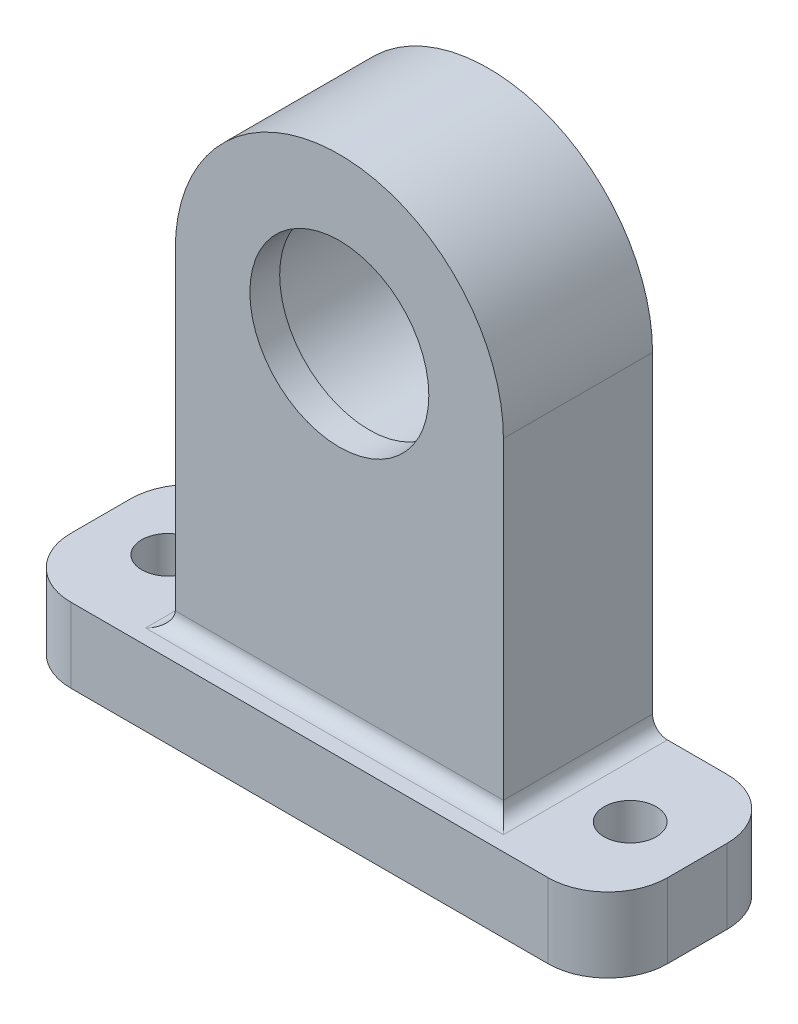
from build123d import *

# Parameters (mm, degrees)
BOSS_EXTRUDE1_DEPTH = 10
SKETCH2_W           = 40
SKETCH2_H           = 12
SKETCH2_R           = 1.75
BOSS_EXTRUDE2_DEPTH = 5
SKETCH1_4_R         = 6.5
CUT_EXTRUDE1_DEPTH  = 8
FILLET1_R           = 1
FILLET2_R           = 4
SKETCH3_R           = 6
CUT_EXTRUDE4_DEPTH  = 10


with BuildPart() as part:
    # Sketch1 → Boss-Extrude1 (new body)
    with BuildSketch(Plane.XY):
        with BuildLine():
            Line((-11, 0), (-11, -22))
            Line((-11, -22), (11, -22))
            Line((11, -22), (11, 0))
            ThreePointArc((11, 0), (0, 11), (-11, 0))
        make_face()
    extrude(amount=BOSS_EXTRUDE1_DEPTH)

    # Sketch2 → Boss-Extrude2 (add)
    with BuildSketch(Plane.XZ.offset(22)):
        with Locations((0, 6)):
            Rectangle(SKETCH2_W, SKETCH2_H)
        with Locations(Location((15.5, 6, 0), (0, 0, 270))):
            Circle(SKETCH2_R, mode=Mode.SUBTRACT)
        with Locations(Location((-15.5, 6, 0), (0, 0, 90))):
            Circle(SKETCH2_R, mode=Mode.SUBTRACT)
    extrude(amount=BOSS_EXTRUDE2_DEPTH)

    # Sketch1_4 → Cut-Extrude1 (cut)
    with BuildSketch(Plane.XY):
        Circle(SKETCH1_4_R)
    extrude(amount=CUT_EXTRUDE1_DEPTH, mode=Mode.SUBTRACT)

    # Fillet1
    fillet1_edges = [part.edges().sort_by_distance(p)[0] for p in [
        (0, -22, 10),
        (-11, -22, 5),
        (11, -22, 5),
    ]]
    fillet(fillet1_edges, radius=FILLET1_R)

    # Fillet2
    fillet2_edges = [part.edges().sort_by_distance(p)[0] for p in [
        (20, -24.5, 0),
        (20, -24.5, 12),
        (-20, -24.5, 12),
        (-20, -24.5, 0),
    ]]
    fillet(fillet2_edges, radius=FILLET2_R)

    # Sketch3 → Cut-Extrude4 (cut)
    with BuildSketch(Plane.XY.offset(10)):
        Circle(SKETCH3_R)
    extrude(amount=-CUT_EXTRUDE4_DEPTH, mode=Mode.SUBTRACT)


solid = part.part
